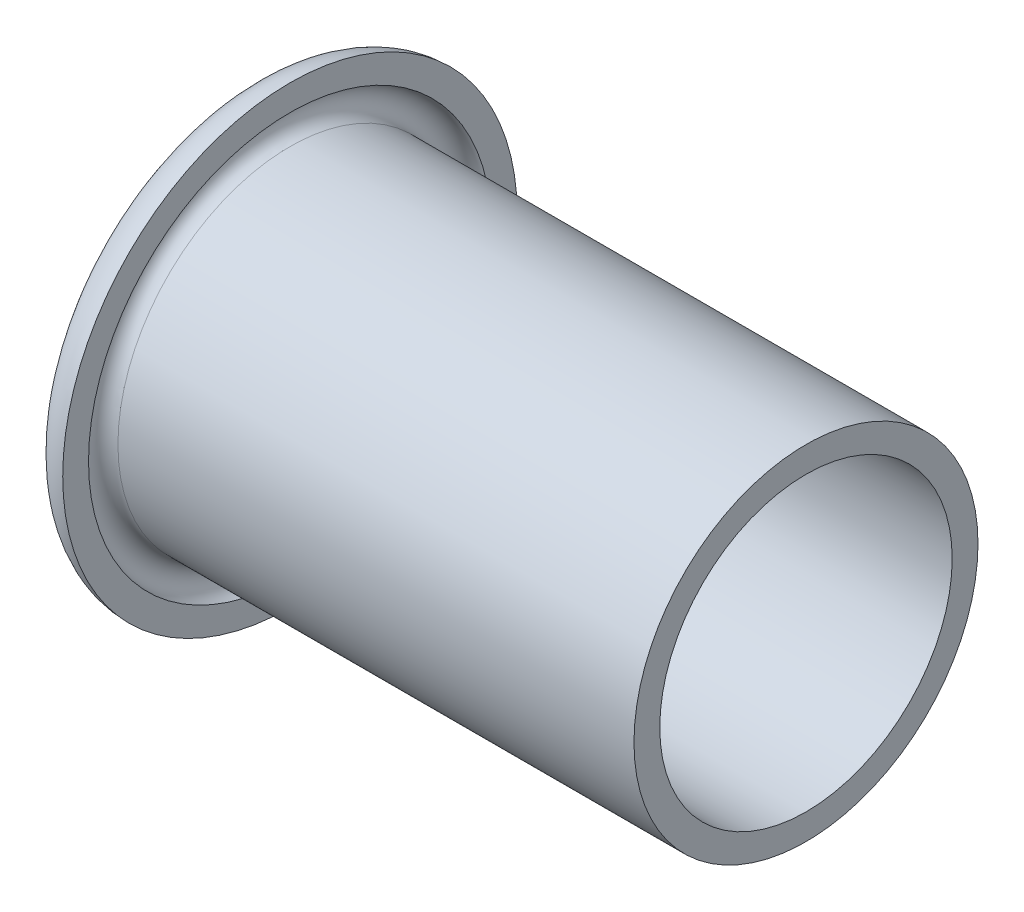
from build123d import *


with BuildPart() as part:
    # Sketch1 → Base-Revolve (revolve)
    with BuildSketch(Plane.XY, mode=Mode.PRIVATE) as base_revolve_sk:
        with BuildLine():
            Line((32.355, 8.5), (32.355, 10))
            Line((32.355, 10), (2.355, 10))
            ThreePointArc((2.355, 10), (1.5, 10.855), (2.355, 11.71))
            Line((2.355, 11.71), (2.355, 13.21))
            ThreePointArc((2.355, 13.21), (0, 10.855), (2.355, 8.5))
            Line((2.355, 8.5), (32.355, 8.5))
        make_face()
    revolve(base_revolve_sk.sketch.rotate(Axis((-26.751259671, 0, 0), (1, 0, 0)), 90), axis=Axis((-26.751259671, 0, 0), (1, 0, 0)))


solid = part.part
